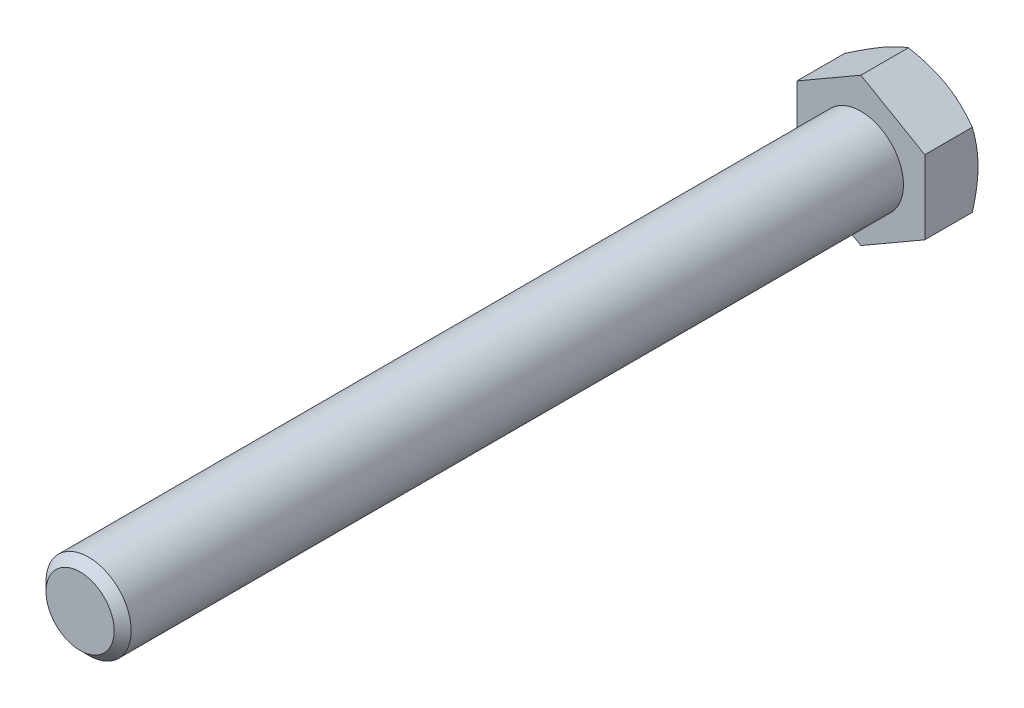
ISO-10303-21;
HEADER;
FILE_DESCRIPTION(('STEP AP214'),'2;1');
FILE_NAME('part.step','',(''),(''),'','','');
FILE_SCHEMA(('AUTOMOTIVE_DESIGN { 1 0 10303 214 1 1 1 1 }'));
ENDSEC;
DATA;
#1=APPLICATION_CONTEXT('core data for automotive mechanical design processes');
#2=APPLICATION_PROTOCOL_DEFINITION('international standard','automotive_design',2000,#1);
#3=PRODUCT_CONTEXT('',#1,'mechanical');
#4=PRODUCT('Part','Part','',(#3));
#5=PRODUCT_RELATED_PRODUCT_CATEGORY('part','',(#4));
#6=PRODUCT_DEFINITION_FORMATION('','',#4);
#7=PRODUCT_DEFINITION_CONTEXT('part definition',#1,'design');
#8=PRODUCT_DEFINITION('design','',#6,#7);
#9=PRODUCT_DEFINITION_SHAPE('','',#8);
#10=(LENGTH_UNIT() NAMED_UNIT(*) SI_UNIT(.MILLI.,.METRE.));
#11=(NAMED_UNIT(*) PLANE_ANGLE_UNIT() SI_UNIT($,.RADIAN.));
#12=(NAMED_UNIT(*) SI_UNIT($,.STERADIAN.) SOLID_ANGLE_UNIT());
#13=UNCERTAINTY_MEASURE_WITH_UNIT(LENGTH_MEASURE(1.E-05),#10,'distance_accuracy_value','');
#14=(GEOMETRIC_REPRESENTATION_CONTEXT(3) GLOBAL_UNCERTAINTY_ASSIGNED_CONTEXT((#13)) GLOBAL_UNIT_ASSIGNED_CONTEXT((#10,
#11,#12)) REPRESENTATION_CONTEXT('',''));
#15=CARTESIAN_POINT('',(0.,0.,0.));
#16=DIRECTION('',(0.,0.,1.));
#17=DIRECTION('',(1.,0.,0.));
#18=AXIS2_PLACEMENT_3D('',#15,#16,#17);
#19=CARTESIAN_POINT('',(0.,0.,110.));
#20=DIRECTION('',(0.,0.,1.));
#21=DIRECTION('',(1.,0.,0.));
#22=AXIS2_PLACEMENT_3D('',#19,#20,#21);
#23=PLANE('',#22);
#24=CARTESIAN_POINT('',(0.,0.,110.));
#25=DIRECTION('',(0.,0.,1.));
#26=DIRECTION('',(1.,0.,0.));
#27=AXIS2_PLACEMENT_3D('',#24,#25,#26);
#28=CIRCLE('',#27,4.80000000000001);
#29=CARTESIAN_POINT('',(4.80000000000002,0.,110.));
#30=VERTEX_POINT('',#29);
#31=EDGE_CURVE('E267',#30,#30,#28,.T.);
#32=ORIENTED_EDGE('',*,*,#31,.T.);
#33=EDGE_LOOP('',(#32));
#34=FACE_BOUND('',#33,.T.);
#35=ADVANCED_FACE('F36',(#34),#23,.T.);
#36=CARTESIAN_POINT('',(0.,0.,0.));
#37=DIRECTION('',(0.,0.,1.));
#38=DIRECTION('',(1.,0.,0.));
#39=AXIS2_PLACEMENT_3D('',#36,#37,#38);
#40=CYLINDRICAL_SURFACE('',#39,6.);
#41=CARTESIAN_POINT('',(0.,0.,108.8));
#42=DIRECTION('',(0.,0.,1.));
#43=DIRECTION('',(1.,0.,0.));
#44=AXIS2_PLACEMENT_3D('',#41,#42,#43);
#45=CIRCLE('',#44,6.);
#46=CARTESIAN_POINT('',(6.00000000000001,0.,108.8));
#47=VERTEX_POINT('',#46);
#48=EDGE_CURVE('E238',#47,#47,#45,.F.);
#49=ORIENTED_EDGE('',*,*,#48,.T.);
#50=EDGE_LOOP('',(#49));
#51=FACE_BOUND('',#50,.T.);
#52=CARTESIAN_POINT('',(0.,0.,0.));
#53=DIRECTION('',(0.,0.,1.));
#54=DIRECTION('',(1.,0.,0.));
#55=AXIS2_PLACEMENT_3D('',#52,#53,#54);
#56=CIRCLE('',#55,6.);
#57=CARTESIAN_POINT('',(6.,0.,0.));
#58=VERTEX_POINT('',#57);
#59=EDGE_CURVE('E264',#58,#58,#56,.F.);
#60=ORIENTED_EDGE('',*,*,#59,.F.);
#61=EDGE_LOOP('',(#60));
#62=FACE_BOUND('',#61,.T.);
#63=ADVANCED_FACE('F202',(#51,#62),#40,.T.);
#64=CARTESIAN_POINT('',(0.,0.,110.));
#65=DIRECTION('',(0.,0.,-1.));
#66=DIRECTION('',(-1.,0.,0.));
#67=AXIS2_PLACEMENT_3D('',#64,#65,#66);
#68=CONICAL_SURFACE('',#67,4.80000000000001,0.785398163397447);
#69=ORIENTED_EDGE('',*,*,#48,.F.);
#70=EDGE_LOOP('',(#69));
#71=FACE_BOUND('',#70,.T.);
#72=ORIENTED_EDGE('',*,*,#31,.F.);
#73=EDGE_LOOP('',(#72));
#74=FACE_BOUND('',#73,.T.);
#75=ADVANCED_FACE('F38',(#71,#74),#68,.T.);
#76=CARTESIAN_POINT('',(0.,10.3923048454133,-7.5));
#77=DIRECTION('',(0.499999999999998,0.86602540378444,0.));
#78=DIRECTION('',(-0.86602540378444,0.499999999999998,0.));
#79=AXIS2_PLACEMENT_3D('',#76,#77,#78);
#80=PLANE('',#79);
#81=CARTESIAN_POINT('',(-0.00020000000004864,10.3924203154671,-6.69608575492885));
#82=CARTESIAN_POINT('',(0.197607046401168,10.2782163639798,-6.76201799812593));
#83=CARTESIAN_POINT('',(0.396185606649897,10.1635669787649,-6.82495859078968));
#84=CARTESIAN_POINT('',(0.794955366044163,9.93333715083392,-6.94403100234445));
#85=CARTESIAN_POINT('',(0.995147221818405,9.8177563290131,-7.00015988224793));
#86=CARTESIAN_POINT('',(1.39751505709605,9.5854491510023,-7.10484803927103));
#87=CARTESIAN_POINT('',(1.59969459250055,9.46872074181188,-7.15338922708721));
#88=CARTESIAN_POINT('',(2.0054287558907,9.23447001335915,-7.24185148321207));
#89=CARTESIAN_POINT('',(2.20898309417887,9.11694786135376,-7.28177431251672));
#90=CARTESIAN_POINT('',(2.61230590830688,8.88408932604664,-7.35131532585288));
#91=CARTESIAN_POINT('',(2.81204459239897,8.76877014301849,-7.3811624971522));
#92=CARTESIAN_POINT('',(3.21241567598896,8.53761579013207,-7.43120669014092));
#93=CARTESIAN_POINT('',(3.41304799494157,8.42178066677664,-7.45140456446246));
#94=CARTESIAN_POINT('',(3.81466063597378,8.18990950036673,-7.48164565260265));
#95=CARTESIAN_POINT('',(4.0156403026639,8.07387383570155,-7.4917003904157));
#96=CARTESIAN_POINT('',(4.41778459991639,7.84169571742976,-7.50143766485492));
#97=CARTESIAN_POINT('',(4.61894922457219,7.7255532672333,-7.50112052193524));
#98=CARTESIAN_POINT('',(4.99503261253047,7.50842142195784,-7.49083604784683));
#99=CARTESIAN_POINT('',(5.16997789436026,7.40741671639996,-7.4821232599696));
#100=CARTESIAN_POINT('',(5.51945867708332,7.2056438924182,-7.45702265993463));
#101=CARTESIAN_POINT('',(5.69399414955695,7.10487579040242,-7.44063433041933));
#102=CARTESIAN_POINT('',(6.21692487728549,6.80296159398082,-7.38034344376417));
#103=CARTESIAN_POINT('',(6.5643945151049,6.60234990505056,-7.32532251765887));
#104=CARTESIAN_POINT('',(7.26301962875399,6.19899850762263,-7.18776952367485));
#105=CARTESIAN_POINT('',(7.61408594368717,5.99631027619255,-7.10465438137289));
#106=CARTESIAN_POINT('',(8.3109833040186,5.59395639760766,-6.91601746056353));
#107=CARTESIAN_POINT('',(8.65682327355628,5.39428559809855,-6.81053998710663));
#108=CARTESIAN_POINT('',(9.0002,5.19603695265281,-6.69608575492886));
#109=B_SPLINE_CURVE_WITH_KNOTS('',3,(#81,#82,#83,#84,#85,#86,#87,#88,#89,#90,#91,#92,#93,#94,
#95,#96,#97,#98,#99,#100,#101,#102,#103,#104,#105,#106,#107,#108),.UNSPECIFIED.,.F.,.F.,(4,2,2,
2,2,2,2,2,2,2,2,2,2,4),(0.,0.713219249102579,1.42674513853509,2.14194697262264,2.85700253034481,
3.55449749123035,4.25193080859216,4.94857085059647,5.64518936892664,6.25162976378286,
6.85811104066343,8.07193747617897,9.31268391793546,10.5509947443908),.UNSPECIFIED.);
#110=CARTESIAN_POINT('',(0.,10.3923048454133,-6.69615242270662));
#111=VERTEX_POINT('',#110);
#112=CARTESIAN_POINT('',(4.49999999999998,7.79422863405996,-7.5));
#113=VERTEX_POINT('',#112);
#114=EDGE_CURVE('E226',#111,#113,#109,.T.);
#115=ORIENTED_EDGE('',*,*,#114,.F.);
#116=DIRECTION('',(0.,0.,1.));
#117=VECTOR('',#116,1.);
#118=CARTESIAN_POINT('',(0.,10.3923048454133,-7.5));
#119=LINE('',#118,#117);
#120=CARTESIAN_POINT('',(0.,10.3923048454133,0.));
#121=VERTEX_POINT('',#120);
#122=EDGE_CURVE('E223',#111,#121,#119,.T.);
#123=ORIENTED_EDGE('',*,*,#122,.T.);
#124=DIRECTION('',(-0.86602540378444,0.499999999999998,0.));
#125=VECTOR('',#124,1.);
#126=CARTESIAN_POINT('',(0.,10.3923048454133,0.));
#127=LINE('',#126,#125);
#128=CARTESIAN_POINT('',(9.00000000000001,5.19615242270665,0.));
#129=VERTEX_POINT('',#128);
#130=EDGE_CURVE('E231',#129,#121,#127,.T.);
#131=ORIENTED_EDGE('',*,*,#130,.F.);
#132=DIRECTION('',(0.,0.,1.));
#133=VECTOR('',#132,1.);
#134=CARTESIAN_POINT('',(9.00000000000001,5.19615242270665,-7.5));
#135=LINE('',#134,#133);
#136=CARTESIAN_POINT('',(9.00000000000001,5.19615242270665,-6.69615242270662));
#137=VERTEX_POINT('',#136);
#138=EDGE_CURVE('E256',#137,#129,#135,.T.);
#139=ORIENTED_EDGE('',*,*,#138,.F.);
#140=EDGE_CURVE('E176',#113,#137,#109,.T.);
#141=ORIENTED_EDGE('',*,*,#140,.F.);
#142=EDGE_LOOP('',(#115,#123,#131,#139,#141));
#143=FACE_BOUND('',#142,.T.);
#144=ADVANCED_FACE('F186',(#143),#80,.T.);
#145=CARTESIAN_POINT('',(9.00000000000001,-5.19615242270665,-7.5));
#146=DIRECTION('',(1.,0.,0.));
#147=DIRECTION('',(0.,0.,-1.));
#148=AXIS2_PLACEMENT_3D('',#145,#146,#147);
#149=PLANE('',#148);
#150=CARTESIAN_POINT('',(9.00000000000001,-14.1938054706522,-2.99281770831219));
#151=CARTESIAN_POINT('',(9.00000000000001,-13.7986249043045,-3.18545400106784));
#152=CARTESIAN_POINT('',(9.00000000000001,-13.4025620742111,-3.37631016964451));
#153=CARTESIAN_POINT('',(9.00000000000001,-12.6082034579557,-3.75346543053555));
#154=CARTESIAN_POINT('',(9.00000000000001,-12.2099073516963,-3.93976384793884));
#155=CARTESIAN_POINT('',(9.00000000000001,-11.4086732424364,-4.30769386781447));
#156=CARTESIAN_POINT('',(9.00000000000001,-11.005721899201,-4.48929651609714));
#157=CARTESIAN_POINT('',(9.00000000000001,-10.1966954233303,-4.84537774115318));
#158=CARTESIAN_POINT('',(9.00000000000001,-9.79062043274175,-5.01985663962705));
#159=CARTESIAN_POINT('',(9.00000000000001,-8.96081603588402,-5.36560228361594));
#160=CARTESIAN_POINT('',(9.00000000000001,-8.53695616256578,-5.5365575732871));
#161=CARTESIAN_POINT('',(9.00000000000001,-7.68436682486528,-5.86609252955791));
#162=CARTESIAN_POINT('',(9.00000000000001,-7.25563683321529,-6.02467084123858));
#163=CARTESIAN_POINT('',(9.00000000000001,-6.39334839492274,-6.3254614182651));
#164=CARTESIAN_POINT('',(9.00000000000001,-5.95980093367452,-6.46770484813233));
#165=CARTESIAN_POINT('',(9.00000000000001,-5.08650675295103,-6.73142002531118));
#166=CARTESIAN_POINT('',(9.00000000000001,-4.64676195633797,-6.85289806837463));
#167=CARTESIAN_POINT('',(9.00000000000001,-3.7631885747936,-7.06875933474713));
#168=CARTESIAN_POINT('',(9.00000000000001,-3.31939822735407,-7.16329494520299));
#169=CARTESIAN_POINT('',(9.00000000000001,-2.64948950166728,-7.28091249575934));
#170=CARTESIAN_POINT('',(9.00000000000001,-2.42546830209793,-7.31608884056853));
#171=CARTESIAN_POINT('',(9.00000000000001,-1.97623392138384,-7.37769613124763));
#172=CARTESIAN_POINT('',(9.00000000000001,-1.75102085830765,-7.40412792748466));
#173=CARTESIAN_POINT('',(9.00000000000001,-1.30274989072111,-7.44737513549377));
#174=CARTESIAN_POINT('',(9.00000000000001,-1.07970414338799,-7.46431601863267));
#175=CARTESIAN_POINT('',(9.00000000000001,-0.633095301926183,-7.4887410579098));
#176=CARTESIAN_POINT('',(9.00000000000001,-0.409532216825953,-7.49622537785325));
#177=CARTESIAN_POINT('',(9.00000000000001,0.0377121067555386,-7.50155767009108));
#178=CARTESIAN_POINT('',(9.00000000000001,0.261393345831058,-7.49940559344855));
#179=CARTESIAN_POINT('',(9.00000000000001,0.708460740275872,-7.48552018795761));
#180=CARTESIAN_POINT('',(9.00000000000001,0.931846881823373,-7.47378642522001));
#181=CARTESIAN_POINT('',(9.00000000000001,1.46162752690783,-7.43485039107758));
#182=CARTESIAN_POINT('',(9.00000000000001,1.76772399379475,-7.40349650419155));
#183=CARTESIAN_POINT('',(9.00000000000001,2.37778404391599,-7.32445593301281));
#184=CARTESIAN_POINT('',(9.00000000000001,2.6817473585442,-7.27676722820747));
#185=CARTESIAN_POINT('',(9.00000000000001,3.59000335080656,-7.1117163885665));
#186=CARTESIAN_POINT('',(9.00000000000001,4.19036603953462,-6.9723942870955));
#187=CARTESIAN_POINT('',(9.00000000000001,5.08858153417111,-6.72898039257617));
#188=CARTESIAN_POINT('',(9.00000000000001,5.39104017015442,-6.64089135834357));
#189=CARTESIAN_POINT('',(9.00000000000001,5.99302412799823,-6.4551143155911));
#190=CARTESIAN_POINT('',(9.00000000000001,6.29254942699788,-6.35742623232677));
#191=CARTESIAN_POINT('',(9.00000000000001,6.88875586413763,-6.15405553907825));
#192=CARTESIAN_POINT('',(9.00000000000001,7.18543776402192,-6.0483751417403));
#193=CARTESIAN_POINT('',(9.00000000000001,7.77631041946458,-5.83030807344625));
#194=CARTESIAN_POINT('',(9.00000000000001,8.07050123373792,-5.71792156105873));
#195=CARTESIAN_POINT('',(9.00000000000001,8.86768097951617,-5.40462740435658));
#196=CARTESIAN_POINT('',(9.00000000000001,9.36851420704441,-5.19823951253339));
#197=CARTESIAN_POINT('',(9.00000000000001,10.3649647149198,-4.77318997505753));
#198=CARTESIAN_POINT('',(9.00000000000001,10.860581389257,-4.5545269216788));
#199=CARTESIAN_POINT('',(9.00000000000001,11.8478077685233,-4.10785524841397));
#200=CARTESIAN_POINT('',(9.00000000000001,12.3394158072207,-3.87984295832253));
#201=CARTESIAN_POINT('',(9.00000000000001,13.3192435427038,-3.41672758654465));
#202=CARTESIAN_POINT('',(9.00000000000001,13.8074633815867,-3.18162480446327));
#203=CARTESIAN_POINT('',(9.00000000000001,14.7819931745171,-2.70549247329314));
#204=CARTESIAN_POINT('',(9.00000000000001,15.2682986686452,-2.46445381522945));
#205=CARTESIAN_POINT('',(9.00000000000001,16.2387067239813,-1.97797920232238));
#206=CARTESIAN_POINT('',(9.00000000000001,16.7228092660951,-1.73254320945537));
#207=CARTESIAN_POINT('',(9.00000000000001,17.6890969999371,-1.23819989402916));
#208=CARTESIAN_POINT('',(9.00000000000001,18.1712826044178,-0.989293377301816));
#209=CARTESIAN_POINT('',(9.00000000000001,19.1341609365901,-0.48860773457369));
#210=CARTESIAN_POINT('',(9.00000000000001,19.6148536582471,-0.236828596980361));
#211=CARTESIAN_POINT('',(9.00000000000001,20.9522159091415,0.46783942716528));
#212=CARTESIAN_POINT('',(9.00000000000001,21.8075292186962,0.92330168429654));
#213=CARTESIAN_POINT('',(9.00000000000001,23.5152984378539,1.83966951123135));
#214=CARTESIAN_POINT('',(9.00000000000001,24.3677541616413,2.3005754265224));
#215=CARTESIAN_POINT('',(9.00000000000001,26.0675482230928,3.22485857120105));
#216=CARTESIAN_POINT('',(9.00000000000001,26.9148940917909,3.68822195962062));
#217=CARTESIAN_POINT('',(9.00000000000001,28.1846057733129,4.38556367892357));
#218=CARTESIAN_POINT('',(9.00000000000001,28.6076082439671,4.61838432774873));
#219=CARTESIAN_POINT('',(9.00000000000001,29.4532343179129,5.08471147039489));
#220=CARTESIAN_POINT('',(9.00000000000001,29.8758579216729,5.31821796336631));
#221=CARTESIAN_POINT('',(9.00000000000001,30.2983153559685,5.55202477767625));
#222=B_SPLINE_CURVE_WITH_KNOTS('',3,(#150,#151,#152,#153,#154,#155,#156,#157,#158,#159,#160,
#161,#162,#163,#164,#165,#166,#167,#168,#169,#170,#171,#172,#173,#174,#175,#176,#177,#178,#179,
#180,#181,#182,#183,#184,#185,#186,#187,#188,#189,#190,#191,#192,#193,#194,#195,#196,#197,#198,
#199,#200,#201,#202,#203,#204,#205,#206,#207,#208,#209,#210,#211,#212,#213,#214,#215,#216,#217,
#218,#219,#220,#221),.UNSPECIFIED.,.F.,.F.,(4,2,2,2,2,2,2,2,2,2,2,2,2,2,2,2,2,2,2,2,2,2,2,2,2,2,
2,2,2,2,2,2,2,2,2,4),(0.,1.31891143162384,2.63801699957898,3.9639117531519,5.28974656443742,
6.66070766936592,8.03181864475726,9.40026868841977,10.7683030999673,12.1284389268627,
12.8085936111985,13.488682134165,14.1595537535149,14.8304137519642,15.5012771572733,
16.172170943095,17.094749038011,18.0174412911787,19.8637129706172,20.808703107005,
21.7537006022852,22.6984374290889,23.6431519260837,25.267980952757,26.8929966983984,
28.5186565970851,30.1442479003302,31.7725119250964,33.4007900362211,35.0286961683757,
36.6566088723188,39.5636489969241,42.4708746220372,45.3681585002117,46.8166845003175,
48.2652087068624),.UNSPECIFIED.);
#223=CARTESIAN_POINT('',(9.,0.,-7.5));
#224=VERTEX_POINT('',#223);
#225=EDGE_CURVE('E174',#137,#224,#222,.F.);
#226=ORIENTED_EDGE('',*,*,#225,.F.);
#227=ORIENTED_EDGE('',*,*,#138,.T.);
#228=DIRECTION('',(0.,1.,0.));
#229=VECTOR('',#228,1.);
#230=CARTESIAN_POINT('',(9.00000000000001,-5.19615242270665,0.));
#231=LINE('',#230,#229);
#232=CARTESIAN_POINT('',(9.00000000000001,-5.19615242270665,0.));
#233=VERTEX_POINT('',#232);
#234=EDGE_CURVE('E263',#233,#129,#231,.T.);
#235=ORIENTED_EDGE('',*,*,#234,.F.);
#236=DIRECTION('',(0.,0.,1.));
#237=VECTOR('',#236,1.);
#238=CARTESIAN_POINT('',(9.00000000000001,-5.19615242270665,-7.5));
#239=LINE('',#238,#237);
#240=CARTESIAN_POINT('',(9.00000000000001,-5.19615242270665,-6.69615242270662));
#241=VERTEX_POINT('',#240);
#242=EDGE_CURVE('E241',#241,#233,#239,.T.);
#243=ORIENTED_EDGE('',*,*,#242,.F.);
#244=EDGE_CURVE('E169',#224,#241,#222,.F.);
#245=ORIENTED_EDGE('',*,*,#244,.F.);
#246=EDGE_LOOP('',(#226,#227,#235,#243,#245));
#247=FACE_BOUND('',#246,.T.);
#248=ADVANCED_FACE('F182',(#247),#149,.T.);
#249=CARTESIAN_POINT('',(0.,-10.3923048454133,-7.5));
#250=DIRECTION('',(0.499999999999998,-0.86602540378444,0.));
#251=DIRECTION('',(0.86602540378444,0.499999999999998,0.));
#252=AXIS2_PLACEMENT_3D('',#249,#250,#251);
#253=PLANE('',#252);
#254=CARTESIAN_POINT('',(9.0002,-5.19603695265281,-6.69608575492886));
#255=CARTESIAN_POINT('',(8.80239295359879,-5.31024090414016,-6.76201799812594));
#256=CARTESIAN_POINT('',(8.60381439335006,-5.42489028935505,-6.82495859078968));
#257=CARTESIAN_POINT('',(8.20504463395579,-5.65512011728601,-6.94403100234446));
#258=CARTESIAN_POINT('',(8.00485277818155,-5.77070093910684,-7.00015988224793));
#259=CARTESIAN_POINT('',(7.6024849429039,-6.00300811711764,-7.10484803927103));
#260=CARTESIAN_POINT('',(7.4003054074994,-6.11973652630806,-7.15338922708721));
#261=CARTESIAN_POINT('',(6.99457124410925,-6.35398725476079,-7.24185148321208));
#262=CARTESIAN_POINT('',(6.79101690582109,-6.47150940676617,-7.28177431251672));
#263=CARTESIAN_POINT('',(6.38769409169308,-6.70436794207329,-7.35131532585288));
#264=CARTESIAN_POINT('',(6.18795540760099,-6.81968712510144,-7.3811624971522));
#265=CARTESIAN_POINT('',(5.787584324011,-7.05084147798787,-7.43120669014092));
#266=CARTESIAN_POINT('',(5.58695200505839,-7.16667660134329,-7.45140456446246));
#267=CARTESIAN_POINT('',(5.18533936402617,-7.3985477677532,-7.48164565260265));
#268=CARTESIAN_POINT('',(4.98435969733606,-7.51458343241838,-7.4917003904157));
#269=CARTESIAN_POINT('',(4.58221540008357,-7.74676155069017,-7.50143766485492));
#270=CARTESIAN_POINT('',(4.38105077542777,-7.86290400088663,-7.50112052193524));
#271=CARTESIAN_POINT('',(4.00496738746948,-8.08003584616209,-7.49083604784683));
#272=CARTESIAN_POINT('',(3.83002210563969,-8.18104055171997,-7.4821232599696));
#273=CARTESIAN_POINT('',(3.48054132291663,-8.38281337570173,-7.45702265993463));
#274=CARTESIAN_POINT('',(3.30600585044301,-8.48358147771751,-7.44063433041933));
#275=CARTESIAN_POINT('',(2.78307512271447,-8.78549567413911,-7.38034344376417));
#276=CARTESIAN_POINT('',(2.43560548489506,-8.98610736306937,-7.32532251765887));
#277=CARTESIAN_POINT('',(1.73698037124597,-9.38945876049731,-7.18776952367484));
#278=CARTESIAN_POINT('',(1.38591405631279,-9.59214699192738,-7.10465438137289));
#279=CARTESIAN_POINT('',(0.689016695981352,-9.99450087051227,-6.91601746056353));
#280=CARTESIAN_POINT('',(0.343176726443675,-10.1941716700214,-6.81053998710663));
#281=CARTESIAN_POINT('',(-0.000200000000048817,-10.3924203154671,-6.69608575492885));
#282=B_SPLINE_CURVE_WITH_KNOTS('',3,(#254,#255,#256,#257,#258,#259,#260,#261,#262,#263,#264,
#265,#266,#267,#268,#269,#270,#271,#272,#273,#274,#275,#276,#277,#278,#279,#280,#281),
.UNSPECIFIED.,.F.,.F.,(4,2,2,2,2,2,2,2,2,2,2,2,2,4),(0.,0.71321924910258,1.42674513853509,
2.14194697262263,2.85700253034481,3.55449749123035,4.25193080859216,4.94857085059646,
5.64518936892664,6.25162976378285,6.85811104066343,8.07193747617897,9.31268391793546,
10.5509947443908),.UNSPECIFIED.);
#283=CARTESIAN_POINT('',(4.49999999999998,-7.79422863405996,-7.5));
#284=VERTEX_POINT('',#283);
#285=EDGE_CURVE('E175',#241,#284,#282,.T.);
#286=ORIENTED_EDGE('',*,*,#285,.F.);
#287=ORIENTED_EDGE('',*,*,#242,.T.);
#288=DIRECTION('',(0.86602540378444,0.499999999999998,0.));
#289=VECTOR('',#288,1.);
#290=CARTESIAN_POINT('',(0.,-10.3923048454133,0.));
#291=LINE('',#290,#289);
#292=CARTESIAN_POINT('',(0.,-10.3923048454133,0.));
#293=VERTEX_POINT('',#292);
#294=EDGE_CURVE('E252',#293,#233,#291,.T.);
#295=ORIENTED_EDGE('',*,*,#294,.F.);
#296=DIRECTION('',(0.,0.,1.));
#297=VECTOR('',#296,1.);
#298=CARTESIAN_POINT('',(0.,-10.3923048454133,-7.5));
#299=LINE('',#298,#297);
#300=CARTESIAN_POINT('',(0.,-10.3923048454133,-6.69615242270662));
#301=VERTEX_POINT('',#300);
#302=EDGE_CURVE('E251',#301,#293,#299,.T.);
#303=ORIENTED_EDGE('',*,*,#302,.F.);
#304=EDGE_CURVE('E163',#284,#301,#282,.T.);
#305=ORIENTED_EDGE('',*,*,#304,.F.);
#306=EDGE_LOOP('',(#286,#287,#295,#303,#305));
#307=FACE_BOUND('',#306,.T.);
#308=ADVANCED_FACE('F185',(#307),#253,.T.);
#309=CARTESIAN_POINT('',(0.,-10.3923048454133,-7.5));
#310=DIRECTION('',(-0.500000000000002,-0.866025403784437,0.));
#311=DIRECTION('',(0.866025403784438,-0.500000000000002,0.));
#312=AXIS2_PLACEMENT_3D('',#309,#310,#311);
#313=PLANE('',#312);
#314=CARTESIAN_POINT('',(0.000199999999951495,-10.3924203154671,-6.69608575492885));
#315=CARTESIAN_POINT('',(-0.197607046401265,-10.2782163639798,-6.76201799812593));
#316=CARTESIAN_POINT('',(-0.396185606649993,-10.1635669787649,-6.82495859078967));
#317=CARTESIAN_POINT('',(-0.794955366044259,-9.93333715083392,-6.94403100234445));
#318=CARTESIAN_POINT('',(-0.9951472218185,-9.81775632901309,-7.00015988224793));
#319=CARTESIAN_POINT('',(-1.39751505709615,-9.58544915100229,-7.10484803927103));
#320=CARTESIAN_POINT('',(-1.59969459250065,-9.46872074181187,-7.1533892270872));
#321=CARTESIAN_POINT('',(-2.0054287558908,-9.23447001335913,-7.24185148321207));
#322=CARTESIAN_POINT('',(-2.20898309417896,-9.11694786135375,-7.28177431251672));
#323=CARTESIAN_POINT('',(-2.61230590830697,-8.88408932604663,-7.35131532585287));
#324=CARTESIAN_POINT('',(-2.81204459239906,-8.76877014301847,-7.38116249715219));
#325=CARTESIAN_POINT('',(-3.21241567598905,-8.53761579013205,-7.43120669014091));
#326=CARTESIAN_POINT('',(-3.41304799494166,-8.42178066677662,-7.45140456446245));
#327=CARTESIAN_POINT('',(-3.81466063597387,-8.18990950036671,-7.48164565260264));
#328=CARTESIAN_POINT('',(-4.01564030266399,-8.07387383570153,-7.49170039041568));
#329=CARTESIAN_POINT('',(-4.41778459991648,-7.84169571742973,-7.5014376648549));
#330=CARTESIAN_POINT('',(-4.61894922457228,-7.72555326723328,-7.50112052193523));
#331=CARTESIAN_POINT('',(-4.99503261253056,-7.50842142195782,-7.49083604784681));
#332=CARTESIAN_POINT('',(-5.16997789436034,-7.40741671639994,-7.48212325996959));
#333=CARTESIAN_POINT('',(-5.51945867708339,-7.20564389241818,-7.45702265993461));
#334=CARTESIAN_POINT('',(-5.69399414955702,-7.1048757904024,-7.44063433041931));
#335=CARTESIAN_POINT('',(-6.21692487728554,-6.8029615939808,-7.38034344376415));
#336=CARTESIAN_POINT('',(-6.56439451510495,-6.60234990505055,-7.32532251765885));
#337=CARTESIAN_POINT('',(-7.26301962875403,-6.19899850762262,-7.18776952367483));
#338=CARTESIAN_POINT('',(-7.6140859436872,-5.99631027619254,-7.10465438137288));
#339=CARTESIAN_POINT('',(-8.31098330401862,-5.59395639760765,-6.91601746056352));
#340=CARTESIAN_POINT('',(-8.65682327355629,-5.39428559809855,-6.81053998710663));
#341=CARTESIAN_POINT('',(-9.0002,-5.19603695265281,-6.69608575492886));
#342=B_SPLINE_CURVE_WITH_KNOTS('',3,(#314,#315,#316,#317,#318,#319,#320,#321,#322,#323,#324,
#325,#326,#327,#328,#329,#330,#331,#332,#333,#334,#335,#336,#337,#338,#339,#340,#341),
.UNSPECIFIED.,.F.,.F.,(4,2,2,2,2,2,2,2,2,2,2,2,2,4),(0.,0.713219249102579,1.42674513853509,
2.14194697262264,2.85700253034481,3.55449749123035,4.25193080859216,4.94857085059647,
5.64518936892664,6.25162976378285,6.85811104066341,8.07193747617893,9.31268391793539,
10.5509947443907),.UNSPECIFIED.);
#343=CARTESIAN_POINT('',(-4.50000000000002,-7.79422863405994,-7.5));
#344=VERTEX_POINT('',#343);
#345=EDGE_CURVE('E247',#301,#344,#342,.T.);
#346=ORIENTED_EDGE('',*,*,#345,.F.);
#347=ORIENTED_EDGE('',*,*,#302,.T.);
#348=DIRECTION('',(0.866025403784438,-0.500000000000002,0.));
#349=VECTOR('',#348,1.);
#350=CARTESIAN_POINT('',(0.,-10.3923048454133,0.));
#351=LINE('',#350,#349);
#352=CARTESIAN_POINT('',(-9.00000000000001,-5.19615242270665,0.));
#353=VERTEX_POINT('',#352);
#354=EDGE_CURVE('E389',#353,#293,#351,.T.);
#355=ORIENTED_EDGE('',*,*,#354,.F.);
#356=DIRECTION('',(0.,0.,1.));
#357=VECTOR('',#356,1.);
#358=CARTESIAN_POINT('',(-9.00000000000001,-5.19615242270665,-7.5));
#359=LINE('',#358,#357);
#360=CARTESIAN_POINT('',(-9.00000000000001,-5.19615242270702,-6.69615242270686));
#361=VERTEX_POINT('',#360);
#362=EDGE_CURVE('E254',#361,#353,#359,.T.);
#363=ORIENTED_EDGE('',*,*,#362,.F.);
#364=EDGE_CURVE('E113',#344,#361,#342,.T.);
#365=ORIENTED_EDGE('',*,*,#364,.F.);
#366=EDGE_LOOP('',(#346,#347,#355,#363,#365));
#367=FACE_BOUND('',#366,.T.);
#368=ADVANCED_FACE('F191',(#367),#313,.T.);
#369=CARTESIAN_POINT('',(-9.00000000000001,-5.19615242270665,-7.5));
#370=DIRECTION('',(-1.,0.,0.));
#371=DIRECTION('',(0.,0.,1.));
#372=AXIS2_PLACEMENT_3D('',#369,#370,#371);
#373=PLANE('',#372);
#374=CARTESIAN_POINT('',(-9.00000000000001,-14.1938054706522,-2.99281770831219));
#375=CARTESIAN_POINT('',(-9.00000000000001,-13.7986249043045,-3.18545400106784));
#376=CARTESIAN_POINT('',(-9.00000000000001,-13.4025620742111,-3.37631016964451));
#377=CARTESIAN_POINT('',(-9.00000000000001,-12.6082034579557,-3.75346543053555));
#378=CARTESIAN_POINT('',(-9.00000000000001,-12.2099073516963,-3.93976384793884));
#379=CARTESIAN_POINT('',(-9.00000000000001,-11.4086732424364,-4.30769386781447));
#380=CARTESIAN_POINT('',(-9.00000000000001,-11.005721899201,-4.48929651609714));
#381=CARTESIAN_POINT('',(-9.00000000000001,-10.1966954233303,-4.84537774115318));
#382=CARTESIAN_POINT('',(-9.00000000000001,-9.79062043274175,-5.01985663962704));
#383=CARTESIAN_POINT('',(-9.00000000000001,-8.96081603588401,-5.36560228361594));
#384=CARTESIAN_POINT('',(-9.00000000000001,-8.53695616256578,-5.5365575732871));
#385=CARTESIAN_POINT('',(-9.00000000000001,-7.68436682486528,-5.86609252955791));
#386=CARTESIAN_POINT('',(-9.00000000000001,-7.25563683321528,-6.02467084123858));
#387=CARTESIAN_POINT('',(-9.00000000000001,-6.39334839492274,-6.3254614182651));
#388=CARTESIAN_POINT('',(-9.00000000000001,-5.95980093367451,-6.46770484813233));
#389=CARTESIAN_POINT('',(-9.00000000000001,-5.08650675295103,-6.73142002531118));
#390=CARTESIAN_POINT('',(-9.00000000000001,-4.64676195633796,-6.85289806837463));
#391=CARTESIAN_POINT('',(-9.00000000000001,-3.76318857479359,-7.06875933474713));
#392=CARTESIAN_POINT('',(-9.00000000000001,-3.31939822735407,-7.16329494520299));
#393=CARTESIAN_POINT('',(-9.00000000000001,-2.64948950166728,-7.28091249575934));
#394=CARTESIAN_POINT('',(-9.00000000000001,-2.42546830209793,-7.31608884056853));
#395=CARTESIAN_POINT('',(-9.00000000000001,-1.97623392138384,-7.37769613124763));
#396=CARTESIAN_POINT('',(-9.00000000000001,-1.75102085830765,-7.40412792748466));
#397=CARTESIAN_POINT('',(-9.00000000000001,-1.30274989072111,-7.44737513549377));
#398=CARTESIAN_POINT('',(-9.00000000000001,-1.07970414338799,-7.46431601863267));
#399=CARTESIAN_POINT('',(-9.00000000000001,-0.633095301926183,-7.4887410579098));
#400=CARTESIAN_POINT('',(-9.00000000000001,-0.409532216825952,-7.49622537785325));
#401=CARTESIAN_POINT('',(-9.00000000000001,0.0377121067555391,-7.50155767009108));
#402=CARTESIAN_POINT('',(-9.00000000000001,0.261393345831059,-7.49940559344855));
#403=CARTESIAN_POINT('',(-9.00000000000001,0.708460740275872,-7.48552018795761));
#404=CARTESIAN_POINT('',(-9.00000000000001,0.931846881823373,-7.47378642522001));
#405=CARTESIAN_POINT('',(-9.00000000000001,1.46162752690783,-7.43485039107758));
#406=CARTESIAN_POINT('',(-9.00000000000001,1.76772399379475,-7.40349650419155));
#407=CARTESIAN_POINT('',(-9.00000000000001,2.37778404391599,-7.32445593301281));
#408=CARTESIAN_POINT('',(-9.00000000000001,2.6817473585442,-7.27676722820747));
#409=CARTESIAN_POINT('',(-9.00000000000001,3.59000335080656,-7.1117163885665));
#410=CARTESIAN_POINT('',(-9.00000000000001,4.19036603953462,-6.9723942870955));
#411=CARTESIAN_POINT('',(-9.00000000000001,5.08858153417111,-6.72898039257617));
#412=CARTESIAN_POINT('',(-9.00000000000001,5.39104017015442,-6.64089135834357));
#413=CARTESIAN_POINT('',(-9.00000000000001,5.99302412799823,-6.4551143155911));
#414=CARTESIAN_POINT('',(-9.00000000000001,6.29254942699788,-6.35742623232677));
#415=CARTESIAN_POINT('',(-9.00000000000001,6.88875586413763,-6.15405553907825));
#416=CARTESIAN_POINT('',(-9.00000000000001,7.18543776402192,-6.0483751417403));
#417=CARTESIAN_POINT('',(-9.00000000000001,7.77631041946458,-5.83030807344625));
#418=CARTESIAN_POINT('',(-9.00000000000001,8.07050123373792,-5.71792156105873));
#419=CARTESIAN_POINT('',(-9.00000000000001,8.86768097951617,-5.40462740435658));
#420=CARTESIAN_POINT('',(-9.00000000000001,9.36851420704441,-5.19823951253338));
#421=CARTESIAN_POINT('',(-9.00000000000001,10.3649647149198,-4.77318997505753));
#422=CARTESIAN_POINT('',(-9.00000000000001,10.860581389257,-4.55452692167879));
#423=CARTESIAN_POINT('',(-9.00000000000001,11.8478077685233,-4.10785524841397));
#424=CARTESIAN_POINT('',(-9.00000000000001,12.3394158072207,-3.87984295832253));
#425=CARTESIAN_POINT('',(-9.00000000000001,13.3192435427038,-3.41672758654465));
#426=CARTESIAN_POINT('',(-9.00000000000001,13.8074633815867,-3.18162480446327));
#427=CARTESIAN_POINT('',(-9.00000000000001,14.7819931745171,-2.70549247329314));
#428=CARTESIAN_POINT('',(-9.00000000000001,15.2682986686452,-2.46445381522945));
#429=CARTESIAN_POINT('',(-9.00000000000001,16.2387067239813,-1.97797920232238));
#430=CARTESIAN_POINT('',(-9.00000000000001,16.722809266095,-1.73254320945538));
#431=CARTESIAN_POINT('',(-9.00000000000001,17.6890969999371,-1.23819989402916));
#432=CARTESIAN_POINT('',(-9.00000000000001,18.1712826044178,-0.989293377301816));
#433=CARTESIAN_POINT('',(-9.00000000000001,19.1341609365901,-0.48860773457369));
#434=CARTESIAN_POINT('',(-9.00000000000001,19.6148536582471,-0.236828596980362));
#435=CARTESIAN_POINT('',(-9.00000000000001,20.9522159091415,0.467839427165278));
#436=CARTESIAN_POINT('',(-9.00000000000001,21.8075292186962,0.923301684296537));
#437=CARTESIAN_POINT('',(-9.00000000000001,23.5152984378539,1.83966951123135));
#438=CARTESIAN_POINT('',(-9.00000000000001,24.3677541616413,2.3005754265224));
#439=CARTESIAN_POINT('',(-9.00000000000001,26.0675482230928,3.22485857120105));
#440=CARTESIAN_POINT('',(-9.00000000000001,26.9148940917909,3.68822195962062));
#441=CARTESIAN_POINT('',(-9.00000000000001,28.184605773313,4.38556367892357));
#442=CARTESIAN_POINT('',(-9.00000000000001,28.6076082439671,4.61838432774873));
#443=CARTESIAN_POINT('',(-9.00000000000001,29.4532343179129,5.08471147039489));
#444=CARTESIAN_POINT('',(-9.00000000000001,29.8758579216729,5.31821796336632));
#445=CARTESIAN_POINT('',(-9.00000000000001,30.2983153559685,5.55202477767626));
#446=B_SPLINE_CURVE_WITH_KNOTS('',3,(#374,#375,#376,#377,#378,#379,#380,#381,#382,#383,#384,
#385,#386,#387,#388,#389,#390,#391,#392,#393,#394,#395,#396,#397,#398,#399,#400,#401,#402,#403,
#404,#405,#406,#407,#408,#409,#410,#411,#412,#413,#414,#415,#416,#417,#418,#419,#420,#421,#422,
#423,#424,#425,#426,#427,#428,#429,#430,#431,#432,#433,#434,#435,#436,#437,#438,#439,#440,#441,
#442,#443,#444,#445),.UNSPECIFIED.,.F.,.F.,(4,2,2,2,2,2,2,2,2,2,2,2,2,2,2,2,2,2,2,2,2,2,2,2,2,2,
2,2,2,2,2,2,2,2,2,4),(0.,1.31891143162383,2.63801699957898,3.9639117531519,5.28974656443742,
6.66070766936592,8.03181864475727,9.40026868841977,10.7683030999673,12.1284389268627,
12.8085936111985,13.488682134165,14.1595537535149,14.8304137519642,15.5012771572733,
16.172170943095,17.094749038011,18.0174412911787,19.8637129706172,20.808703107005,
21.7537006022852,22.6984374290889,23.6431519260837,25.267980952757,26.8929966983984,
28.5186565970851,30.1442479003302,31.7725119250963,33.400790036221,35.0286961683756,
36.6566088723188,39.5636489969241,42.4708746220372,45.3681585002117,46.8166845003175,
48.2652087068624),.UNSPECIFIED.);
#447=CARTESIAN_POINT('',(-9.00000000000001,0.,-7.5));
#448=VERTEX_POINT('',#447);
#449=EDGE_CURVE('E108',#361,#448,#446,.T.);
#450=ORIENTED_EDGE('',*,*,#449,.F.);
#451=ORIENTED_EDGE('',*,*,#362,.T.);
#452=DIRECTION('',(0.,-1.,0.));
#453=VECTOR('',#452,1.);
#454=CARTESIAN_POINT('',(-9.00000000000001,-5.19615242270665,0.));
#455=LINE('',#454,#453);
#456=CARTESIAN_POINT('',(-9.00000000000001,5.19615242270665,0.));
#457=VERTEX_POINT('',#456);
#458=EDGE_CURVE('E391',#457,#353,#455,.T.);
#459=ORIENTED_EDGE('',*,*,#458,.F.);
#460=DIRECTION('',(0.,0.,1.));
#461=VECTOR('',#460,1.);
#462=CARTESIAN_POINT('',(-9.00000000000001,5.19615242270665,-7.5));
#463=LINE('',#462,#461);
#464=CARTESIAN_POINT('',(-9.00000000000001,5.19615242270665,-6.69615242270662));
#465=VERTEX_POINT('',#464);
#466=EDGE_CURVE('E134',#465,#457,#463,.T.);
#467=ORIENTED_EDGE('',*,*,#466,.F.);
#468=EDGE_CURVE('E117',#448,#465,#446,.T.);
#469=ORIENTED_EDGE('',*,*,#468,.F.);
#470=EDGE_LOOP('',(#450,#451,#459,#467,#469));
#471=FACE_BOUND('',#470,.T.);
#472=ADVANCED_FACE('F132',(#471),#373,.T.);
#473=CARTESIAN_POINT('',(-9.00000000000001,5.19615242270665,-7.5));
#474=DIRECTION('',(-0.500000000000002,0.866025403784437,0.));
#475=DIRECTION('',(-0.866025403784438,-0.500000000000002,0.));
#476=AXIS2_PLACEMENT_3D('',#473,#474,#475);
#477=PLANE('',#476);
#478=CARTESIAN_POINT('',(-9.0002,5.19603695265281,-6.69608575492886));
#479=CARTESIAN_POINT('',(-8.80239295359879,5.31024090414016,-6.76201799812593));
#480=CARTESIAN_POINT('',(-8.60381439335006,5.42489028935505,-6.82495859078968));
#481=CARTESIAN_POINT('',(-8.20504463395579,5.65512011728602,-6.94403100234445));
#482=CARTESIAN_POINT('',(-8.00485277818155,5.77070093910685,-7.00015988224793));
#483=CARTESIAN_POINT('',(-7.6024849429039,6.00300811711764,-7.10484803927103));
#484=CARTESIAN_POINT('',(-7.40030540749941,6.11973652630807,-7.15338922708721));
#485=CARTESIAN_POINT('',(-6.99457124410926,6.3539872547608,-7.24185148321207));
#486=CARTESIAN_POINT('',(-6.79101690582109,6.47150940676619,-7.28177431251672));
#487=CARTESIAN_POINT('',(-6.38769409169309,6.70436794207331,-7.35131532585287));
#488=CARTESIAN_POINT('',(-6.187955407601,6.81968712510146,-7.38116249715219));
#489=CARTESIAN_POINT('',(-5.787584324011,7.05084147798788,-7.43120669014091));
#490=CARTESIAN_POINT('',(-5.58695200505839,7.16667660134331,-7.45140456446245));
#491=CARTESIAN_POINT('',(-5.18533936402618,7.39854776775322,-7.48164565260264));
#492=CARTESIAN_POINT('',(-4.98435969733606,7.5145834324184,-7.49170039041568));
#493=CARTESIAN_POINT('',(-4.58221540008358,7.7467615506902,-7.5014376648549));
#494=CARTESIAN_POINT('',(-4.38105077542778,7.86290400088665,-7.50112052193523));
#495=CARTESIAN_POINT('',(-4.0049673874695,8.08003584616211,-7.49083604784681));
#496=CARTESIAN_POINT('',(-3.83002210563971,8.18104055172,-7.48212325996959));
#497=CARTESIAN_POINT('',(-3.48054132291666,8.38281337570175,-7.45702265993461));
#498=CARTESIAN_POINT('',(-3.30600585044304,8.48358147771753,-7.44063433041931));
#499=CARTESIAN_POINT('',(-2.78307512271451,8.78549567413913,-7.38034344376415));
#500=CARTESIAN_POINT('',(-2.4356054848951,8.98610736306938,-7.32532251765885));
#501=CARTESIAN_POINT('',(-1.73698037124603,9.38945876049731,-7.18776952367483));
#502=CARTESIAN_POINT('',(-1.38591405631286,9.59214699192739,-7.10465438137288));
#503=CARTESIAN_POINT('',(-0.689016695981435,9.99450087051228,-6.91601746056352));
#504=CARTESIAN_POINT('',(-0.343176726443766,10.1941716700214,-6.81053998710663));
#505=CARTESIAN_POINT('',(0.000199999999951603,10.3924203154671,-6.69608575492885));
#506=B_SPLINE_CURVE_WITH_KNOTS('',3,(#478,#479,#480,#481,#482,#483,#484,#485,#486,#487,#488,
#489,#490,#491,#492,#493,#494,#495,#496,#497,#498,#499,#500,#501,#502,#503,#504,#505),
.UNSPECIFIED.,.F.,.F.,(4,2,2,2,2,2,2,2,2,2,2,2,2,4),(0.,0.71321924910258,1.42674513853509,
2.14194697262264,2.85700253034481,3.55449749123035,4.25193080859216,4.94857085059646,
5.64518936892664,6.25162976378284,6.8581110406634,8.07193747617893,9.31268391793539,
10.5509947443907),.UNSPECIFIED.);
#507=CARTESIAN_POINT('',(-4.50000000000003,7.79422863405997,-7.5));
#508=VERTEX_POINT('',#507);
#509=EDGE_CURVE('E123',#465,#508,#506,.T.);
#510=ORIENTED_EDGE('',*,*,#509,.F.);
#511=ORIENTED_EDGE('',*,*,#466,.T.);
#512=DIRECTION('',(-0.866025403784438,-0.500000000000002,0.));
#513=VECTOR('',#512,1.);
#514=CARTESIAN_POINT('',(-9.00000000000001,5.19615242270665,0.));
#515=LINE('',#514,#513);
#516=EDGE_CURVE('E233',#121,#457,#515,.T.);
#517=ORIENTED_EDGE('',*,*,#516,.F.);
#518=ORIENTED_EDGE('',*,*,#122,.F.);
#519=EDGE_CURVE('E125',#508,#111,#506,.T.);
#520=ORIENTED_EDGE('',*,*,#519,.F.);
#521=EDGE_LOOP('',(#510,#511,#517,#518,#520));
#522=FACE_BOUND('',#521,.T.);
#523=ADVANCED_FACE('F199',(#522),#477,.T.);
#524=CARTESIAN_POINT('',(9.00000000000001,5.19615242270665,0.));
#525=DIRECTION('',(0.,0.,1.));
#526=DIRECTION('',(1.,0.,0.));
#527=AXIS2_PLACEMENT_3D('',#524,#525,#526);
#528=PLANE('',#527);
#529=ORIENTED_EDGE('',*,*,#59,.T.);
#530=EDGE_LOOP('',(#529));
#531=FACE_BOUND('',#530,.T.);
#532=ORIENTED_EDGE('',*,*,#130,.T.);
#533=ORIENTED_EDGE('',*,*,#516,.T.);
#534=ORIENTED_EDGE('',*,*,#458,.T.);
#535=ORIENTED_EDGE('',*,*,#354,.T.);
#536=ORIENTED_EDGE('',*,*,#294,.T.);
#537=ORIENTED_EDGE('',*,*,#234,.T.);
#538=EDGE_LOOP('',(#532,#533,#534,#535,#536,#537));
#539=FACE_BOUND('',#538,.T.);
#540=ADVANCED_FACE('F188',(#531,#539),#528,.T.);
#541=CARTESIAN_POINT('',(0.,0.,0.));
#542=DIRECTION('',(0.,0.,1.));
#543=DIRECTION('',(1.,0.,0.));
#544=AXIS2_PLACEMENT_3D('',#541,#542,#543);
#545=CONICAL_SURFACE('',#544,21.9903810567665,1.0471975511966);
#546=ORIENTED_EDGE('',*,*,#140,.T.);
#547=ORIENTED_EDGE('',*,*,#225,.T.);
#548=CARTESIAN_POINT('',(0.,0.,-7.5));
#549=DIRECTION('',(0.,0.,1.));
#550=DIRECTION('',(1.,0.,0.));
#551=AXIS2_PLACEMENT_3D('',#548,#549,#550);
#552=CIRCLE('',#551,9.);
#553=EDGE_CURVE('E40',#113,#224,#552,.F.);
#554=ORIENTED_EDGE('',*,*,#553,.F.);
#555=EDGE_LOOP('',(#546,#547,#554));
#556=FACE_BOUND('',#555,.T.);
#557=ADVANCED_FACE('F219',(#556),#545,.T.);
#558=ORIENTED_EDGE('',*,*,#114,.T.);
#559=EDGE_CURVE('E130',#508,#113,#552,.F.);
#560=ORIENTED_EDGE('',*,*,#559,.F.);
#561=ORIENTED_EDGE('',*,*,#519,.T.);
#562=EDGE_LOOP('',(#558,#560,#561));
#563=FACE_BOUND('',#562,.T.);
#564=ADVANCED_FACE('F155',(#563),#545,.T.);
#565=ORIENTED_EDGE('',*,*,#468,.T.);
#566=ORIENTED_EDGE('',*,*,#509,.T.);
#567=CARTESIAN_POINT('',(0.,0.,-7.5));
#568=DIRECTION('',(0.,0.,-1.));
#569=DIRECTION('',(-1.,0.,0.));
#570=AXIS2_PLACEMENT_3D('',#567,#568,#569);
#571=CIRCLE('',#570,9.00000000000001);
#572=EDGE_CURVE('E58',#448,#508,#571,.T.);
#573=ORIENTED_EDGE('',*,*,#572,.F.);
#574=EDGE_LOOP('',(#565,#566,#573));
#575=FACE_BOUND('',#574,.T.);
#576=ADVANCED_FACE('F121',(#575),#545,.T.);
#577=ORIENTED_EDGE('',*,*,#364,.T.);
#578=ORIENTED_EDGE('',*,*,#449,.T.);
#579=EDGE_CURVE('E110',#344,#448,#552,.F.);
#580=ORIENTED_EDGE('',*,*,#579,.F.);
#581=EDGE_LOOP('',(#577,#578,#580));
#582=FACE_BOUND('',#581,.T.);
#583=ADVANCED_FACE('F109',(#582),#545,.T.);
#584=ORIENTED_EDGE('',*,*,#304,.T.);
#585=ORIENTED_EDGE('',*,*,#345,.T.);
#586=EDGE_CURVE('E45',#284,#344,#552,.F.);
#587=ORIENTED_EDGE('',*,*,#586,.F.);
#588=EDGE_LOOP('',(#584,#585,#587));
#589=FACE_BOUND('',#588,.T.);
#590=ADVANCED_FACE('F249',(#589),#545,.T.);
#591=ORIENTED_EDGE('',*,*,#244,.T.);
#592=ORIENTED_EDGE('',*,*,#285,.T.);
#593=EDGE_CURVE('E11',#224,#284,#552,.F.);
#594=ORIENTED_EDGE('',*,*,#593,.F.);
#595=EDGE_LOOP('',(#591,#592,#594));
#596=FACE_BOUND('',#595,.T.);
#597=ADVANCED_FACE('F243',(#596),#545,.T.);
#598=CARTESIAN_POINT('',(9.00000000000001,5.19615242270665,-7.5));
#599=DIRECTION('',(0.,0.,1.));
#600=DIRECTION('',(1.,0.,0.));
#601=AXIS2_PLACEMENT_3D('',#598,#599,#600);
#602=PLANE('',#601);
#603=ORIENTED_EDGE('',*,*,#553,.T.);
#604=ORIENTED_EDGE('',*,*,#593,.T.);
#605=ORIENTED_EDGE('',*,*,#586,.T.);
#606=ORIENTED_EDGE('',*,*,#579,.T.);
#607=ORIENTED_EDGE('',*,*,#572,.T.);
#608=ORIENTED_EDGE('',*,*,#559,.T.);
#609=EDGE_LOOP('',(#603,#604,#605,#606,#607,#608));
#610=FACE_BOUND('',#609,.T.);
#611=ADVANCED_FACE('F128',(#610),#602,.F.);
#612=CLOSED_SHELL('',(#35,#63,#75,#144,#248,#308,#368,#472,#523,#540,#557,#564,#576,#583,#590,
#597,#611));
#613=MANIFOLD_SOLID_BREP('B2',#612);
#614=ADVANCED_BREP_SHAPE_REPRESENTATION('',(#18,#613),#14);
#615=SHAPE_DEFINITION_REPRESENTATION(#9,#614);
ENDSEC;
END-ISO-10303-21;
